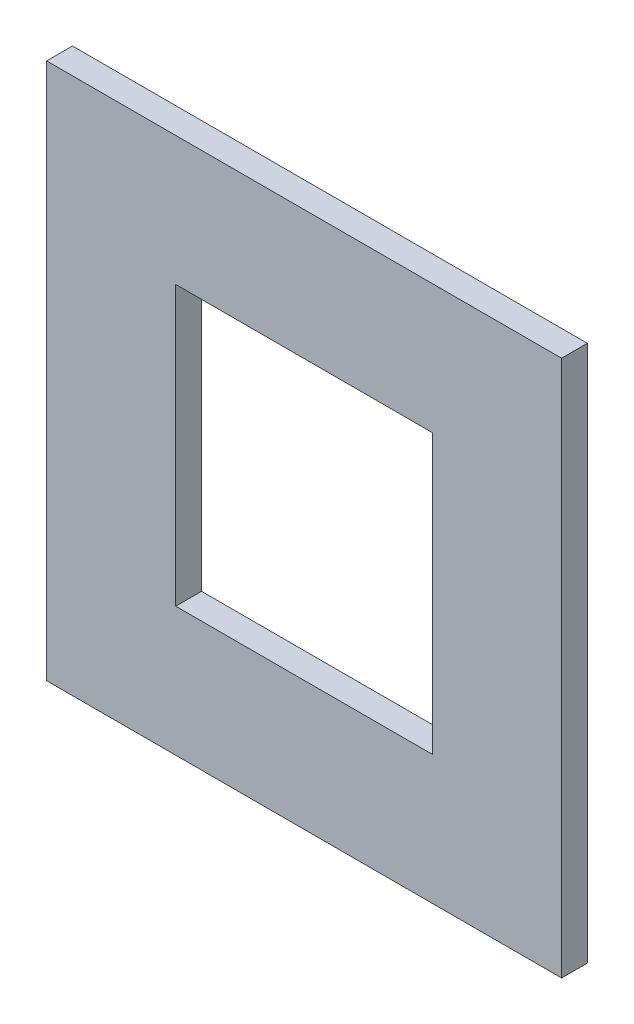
ISO-10303-21;
HEADER;
FILE_DESCRIPTION(('STEP AP214'),'2;1');
FILE_NAME('part.step','',(''),(''),'','','');
FILE_SCHEMA(('AUTOMOTIVE_DESIGN { 1 0 10303 214 1 1 1 1 }'));
ENDSEC;
DATA;
#1=APPLICATION_CONTEXT('core data for automotive mechanical design processes');
#2=APPLICATION_PROTOCOL_DEFINITION('international standard','automotive_design',2000,#1);
#3=PRODUCT_CONTEXT('',#1,'mechanical');
#4=PRODUCT('Part','Part','',(#3));
#5=PRODUCT_RELATED_PRODUCT_CATEGORY('part','',(#4));
#6=PRODUCT_DEFINITION_FORMATION('','',#4);
#7=PRODUCT_DEFINITION_CONTEXT('part definition',#1,'design');
#8=PRODUCT_DEFINITION('design','',#6,#7);
#9=PRODUCT_DEFINITION_SHAPE('','',#8);
#10=(LENGTH_UNIT() NAMED_UNIT(*) SI_UNIT(.MILLI.,.METRE.));
#11=(NAMED_UNIT(*) PLANE_ANGLE_UNIT() SI_UNIT($,.RADIAN.));
#12=(NAMED_UNIT(*) SI_UNIT($,.STERADIAN.) SOLID_ANGLE_UNIT());
#13=UNCERTAINTY_MEASURE_WITH_UNIT(LENGTH_MEASURE(1.E-05),#10,'distance_accuracy_value','');
#14=(GEOMETRIC_REPRESENTATION_CONTEXT(3) GLOBAL_UNCERTAINTY_ASSIGNED_CONTEXT((#13)) GLOBAL_UNIT_ASSIGNED_CONTEXT((#10,
#11,#12)) REPRESENTATION_CONTEXT('',''));
#15=CARTESIAN_POINT('',(0.,0.,0.));
#16=DIRECTION('',(0.,0.,1.));
#17=DIRECTION('',(1.,0.,0.));
#18=AXIS2_PLACEMENT_3D('',#15,#16,#17);
#19=CARTESIAN_POINT('',(0.,0.,15.));
#20=DIRECTION('',(0.,0.,1.));
#21=DIRECTION('',(1.,0.,0.));
#22=AXIS2_PLACEMENT_3D('',#19,#20,#21);
#23=PLANE('',#22);
#24=DIRECTION('',(1.,0.,0.));
#25=VECTOR('',#24,1.);
#26=CARTESIAN_POINT('',(74.6125,-80.9625,15.));
#27=LINE('',#26,#25);
#28=CARTESIAN_POINT('',(-74.6125,-80.9625,15.));
#29=VERTEX_POINT('',#28);
#30=CARTESIAN_POINT('',(74.6125,-80.9625,15.));
#31=VERTEX_POINT('',#30);
#32=EDGE_CURVE('E134',#29,#31,#27,.T.);
#33=ORIENTED_EDGE('',*,*,#32,.F.);
#34=DIRECTION('',(0.,-1.,0.));
#35=VECTOR('',#34,1.);
#36=CARTESIAN_POINT('',(-74.6125,-80.9625,15.));
#37=LINE('',#36,#35);
#38=CARTESIAN_POINT('',(-74.6125,80.9625,15.));
#39=VERTEX_POINT('',#38);
#40=EDGE_CURVE('E132',#39,#29,#37,.T.);
#41=ORIENTED_EDGE('',*,*,#40,.F.);
#42=DIRECTION('',(-1.,0.,0.));
#43=VECTOR('',#42,1.);
#44=CARTESIAN_POINT('',(74.6125,80.9625,15.));
#45=LINE('',#44,#43);
#46=CARTESIAN_POINT('',(74.6125,80.9625,15.));
#47=VERTEX_POINT('',#46);
#48=EDGE_CURVE('E140',#47,#39,#45,.T.);
#49=ORIENTED_EDGE('',*,*,#48,.F.);
#50=DIRECTION('',(0.,1.,0.));
#51=VECTOR('',#50,1.);
#52=CARTESIAN_POINT('',(74.6125,-80.9625,15.));
#53=LINE('',#52,#51);
#54=EDGE_CURVE('E137',#31,#47,#53,.T.);
#55=ORIENTED_EDGE('',*,*,#54,.F.);
#56=EDGE_LOOP('',(#33,#41,#49,#55));
#57=FACE_BOUND('',#56,.T.);
#58=DIRECTION('',(-1.,0.,0.));
#59=VECTOR('',#58,1.);
#60=CARTESIAN_POINT('',(149.6125,-155.9625,15.));
#61=LINE('',#60,#59);
#62=CARTESIAN_POINT('',(149.6125,-155.9625,15.));
#63=VERTEX_POINT('',#62);
#64=CARTESIAN_POINT('',(-149.6125,-155.9625,15.));
#65=VERTEX_POINT('',#64);
#66=EDGE_CURVE('E114',#63,#65,#61,.T.);
#67=ORIENTED_EDGE('',*,*,#66,.F.);
#68=DIRECTION('',(0.,-1.,0.));
#69=VECTOR('',#68,1.);
#70=CARTESIAN_POINT('',(149.6125,155.9625,15.));
#71=LINE('',#70,#69);
#72=CARTESIAN_POINT('',(149.6125,155.9625,15.));
#73=VERTEX_POINT('',#72);
#74=EDGE_CURVE('E48',#73,#63,#71,.T.);
#75=ORIENTED_EDGE('',*,*,#74,.F.);
#76=DIRECTION('',(1.,0.,0.));
#77=VECTOR('',#76,1.);
#78=CARTESIAN_POINT('',(149.6125,155.9625,15.));
#79=LINE('',#78,#77);
#80=CARTESIAN_POINT('',(-149.6125,155.9625,15.));
#81=VERTEX_POINT('',#80);
#82=EDGE_CURVE('E102',#81,#73,#79,.T.);
#83=ORIENTED_EDGE('',*,*,#82,.F.);
#84=DIRECTION('',(0.,1.,0.));
#85=VECTOR('',#84,1.);
#86=CARTESIAN_POINT('',(-149.6125,155.9625,15.));
#87=LINE('',#86,#85);
#88=EDGE_CURVE('E109',#65,#81,#87,.T.);
#89=ORIENTED_EDGE('',*,*,#88,.F.);
#90=EDGE_LOOP('',(#67,#75,#83,#89));
#91=FACE_BOUND('',#90,.T.);
#92=ADVANCED_FACE('F33',(#57,#91),#23,.T.);
#93=CARTESIAN_POINT('',(0.,0.,0.));
#94=DIRECTION('',(0.,0.,1.));
#95=DIRECTION('',(1.,0.,0.));
#96=AXIS2_PLACEMENT_3D('',#93,#94,#95);
#97=PLANE('',#96);
#98=DIRECTION('',(0.,-1.,0.));
#99=VECTOR('',#98,1.);
#100=CARTESIAN_POINT('',(-74.6125,-80.9625,0.));
#101=LINE('',#100,#99);
#102=CARTESIAN_POINT('',(-74.6125,80.9625,0.));
#103=VERTEX_POINT('',#102);
#104=CARTESIAN_POINT('',(-74.6125,-80.9625,0.));
#105=VERTEX_POINT('',#104);
#106=EDGE_CURVE('E129',#103,#105,#101,.T.);
#107=ORIENTED_EDGE('',*,*,#106,.T.);
#108=DIRECTION('',(1.,0.,0.));
#109=VECTOR('',#108,1.);
#110=CARTESIAN_POINT('',(74.6125,-80.9625,0.));
#111=LINE('',#110,#109);
#112=CARTESIAN_POINT('',(74.6125,-80.9625,0.));
#113=VERTEX_POINT('',#112);
#114=EDGE_CURVE('E145',#105,#113,#111,.T.);
#115=ORIENTED_EDGE('',*,*,#114,.T.);
#116=DIRECTION('',(0.,1.,0.));
#117=VECTOR('',#116,1.);
#118=CARTESIAN_POINT('',(74.6125,-80.9625,0.));
#119=LINE('',#118,#117);
#120=CARTESIAN_POINT('',(74.6125,80.9625,0.));
#121=VERTEX_POINT('',#120);
#122=EDGE_CURVE('E148',#113,#121,#119,.T.);
#123=ORIENTED_EDGE('',*,*,#122,.T.);
#124=DIRECTION('',(-1.,0.,0.));
#125=VECTOR('',#124,1.);
#126=CARTESIAN_POINT('',(74.6125,80.9625,0.));
#127=LINE('',#126,#125);
#128=EDGE_CURVE('E135',#121,#103,#127,.T.);
#129=ORIENTED_EDGE('',*,*,#128,.T.);
#130=EDGE_LOOP('',(#107,#115,#123,#129));
#131=FACE_BOUND('',#130,.T.);
#132=DIRECTION('',(0.,-1.,0.));
#133=VECTOR('',#132,1.);
#134=CARTESIAN_POINT('',(149.6125,155.9625,0.));
#135=LINE('',#134,#133);
#136=CARTESIAN_POINT('',(149.6125,155.9625,0.));
#137=VERTEX_POINT('',#136);
#138=CARTESIAN_POINT('',(149.6125,-155.9625,0.));
#139=VERTEX_POINT('',#138);
#140=EDGE_CURVE('E121',#137,#139,#135,.T.);
#141=ORIENTED_EDGE('',*,*,#140,.T.);
#142=DIRECTION('',(-1.,0.,0.));
#143=VECTOR('',#142,1.);
#144=CARTESIAN_POINT('',(149.6125,-155.9625,0.));
#145=LINE('',#144,#143);
#146=CARTESIAN_POINT('',(-149.6125,-155.9625,0.));
#147=VERTEX_POINT('',#146);
#148=EDGE_CURVE('E124',#139,#147,#145,.T.);
#149=ORIENTED_EDGE('',*,*,#148,.T.);
#150=DIRECTION('',(0.,1.,0.));
#151=VECTOR('',#150,1.);
#152=CARTESIAN_POINT('',(-149.6125,155.9625,0.));
#153=LINE('',#152,#151);
#154=CARTESIAN_POINT('',(-149.6125,155.9625,0.));
#155=VERTEX_POINT('',#154);
#156=EDGE_CURVE('E56',#147,#155,#153,.T.);
#157=ORIENTED_EDGE('',*,*,#156,.T.);
#158=DIRECTION('',(1.,0.,0.));
#159=VECTOR('',#158,1.);
#160=CARTESIAN_POINT('',(149.6125,155.9625,0.));
#161=LINE('',#160,#159);
#162=EDGE_CURVE('E104',#155,#137,#161,.T.);
#163=ORIENTED_EDGE('',*,*,#162,.T.);
#164=EDGE_LOOP('',(#141,#149,#157,#163));
#165=FACE_BOUND('',#164,.T.);
#166=ADVANCED_FACE('F35',(#131,#165),#97,.F.);
#167=CARTESIAN_POINT('',(-74.6125,-80.9625,15.));
#168=DIRECTION('',(1.,0.,0.));
#169=DIRECTION('',(0.,0.,-1.));
#170=AXIS2_PLACEMENT_3D('',#167,#168,#169);
#171=PLANE('',#170);
#172=ORIENTED_EDGE('',*,*,#106,.F.);
#173=DIRECTION('',(0.,0.,-1.));
#174=VECTOR('',#173,1.);
#175=CARTESIAN_POINT('',(-74.6125,80.9625,15.));
#176=LINE('',#175,#174);
#177=EDGE_CURVE('E142',#39,#103,#176,.T.);
#178=ORIENTED_EDGE('',*,*,#177,.F.);
#179=ORIENTED_EDGE('',*,*,#40,.T.);
#180=DIRECTION('',(0.,0.,-1.));
#181=VECTOR('',#180,1.);
#182=CARTESIAN_POINT('',(-74.6125,-80.9625,15.));
#183=LINE('',#182,#181);
#184=EDGE_CURVE('E11',#29,#105,#183,.T.);
#185=ORIENTED_EDGE('',*,*,#184,.T.);
#186=EDGE_LOOP('',(#172,#178,#179,#185));
#187=FACE_BOUND('',#186,.T.);
#188=ADVANCED_FACE('F170',(#187),#171,.T.);
#189=CARTESIAN_POINT('',(74.6125,-80.9625,15.));
#190=DIRECTION('',(0.,1.,0.));
#191=DIRECTION('',(-1.,0.,0.));
#192=AXIS2_PLACEMENT_3D('',#189,#190,#191);
#193=PLANE('',#192);
#194=ORIENTED_EDGE('',*,*,#114,.F.);
#195=ORIENTED_EDGE('',*,*,#184,.F.);
#196=ORIENTED_EDGE('',*,*,#32,.T.);
#197=DIRECTION('',(0.,0.,-1.));
#198=VECTOR('',#197,1.);
#199=CARTESIAN_POINT('',(74.6125,-80.9625,15.));
#200=LINE('',#199,#198);
#201=EDGE_CURVE('E41',#31,#113,#200,.T.);
#202=ORIENTED_EDGE('',*,*,#201,.T.);
#203=EDGE_LOOP('',(#194,#195,#196,#202));
#204=FACE_BOUND('',#203,.T.);
#205=ADVANCED_FACE('F159',(#204),#193,.T.);
#206=CARTESIAN_POINT('',(74.6125,-80.9625,15.));
#207=DIRECTION('',(-1.,0.,0.));
#208=DIRECTION('',(0.,0.,1.));
#209=AXIS2_PLACEMENT_3D('',#206,#207,#208);
#210=PLANE('',#209);
#211=ORIENTED_EDGE('',*,*,#122,.F.);
#212=ORIENTED_EDGE('',*,*,#201,.F.);
#213=ORIENTED_EDGE('',*,*,#54,.T.);
#214=DIRECTION('',(0.,0.,-1.));
#215=VECTOR('',#214,1.);
#216=CARTESIAN_POINT('',(74.6125,80.9625,15.));
#217=LINE('',#216,#215);
#218=EDGE_CURVE('E155',#47,#121,#217,.T.);
#219=ORIENTED_EDGE('',*,*,#218,.T.);
#220=EDGE_LOOP('',(#211,#212,#213,#219));
#221=FACE_BOUND('',#220,.T.);
#222=ADVANCED_FACE('F164',(#221),#210,.T.);
#223=CARTESIAN_POINT('',(74.6125,80.9625,15.));
#224=DIRECTION('',(0.,-1.,0.));
#225=DIRECTION('',(1.,0.,0.));
#226=AXIS2_PLACEMENT_3D('',#223,#224,#225);
#227=PLANE('',#226);
#228=ORIENTED_EDGE('',*,*,#128,.F.);
#229=ORIENTED_EDGE('',*,*,#218,.F.);
#230=ORIENTED_EDGE('',*,*,#48,.T.);
#231=ORIENTED_EDGE('',*,*,#177,.T.);
#232=EDGE_LOOP('',(#228,#229,#230,#231));
#233=FACE_BOUND('',#232,.T.);
#234=ADVANCED_FACE('F173',(#233),#227,.T.);
#235=CARTESIAN_POINT('',(149.6125,155.9625,15.));
#236=DIRECTION('',(1.,0.,0.));
#237=DIRECTION('',(0.,1.,0.));
#238=AXIS2_PLACEMENT_3D('',#235,#236,#237);
#239=PLANE('',#238);
#240=ORIENTED_EDGE('',*,*,#140,.F.);
#241=DIRECTION('',(0.,0.,-1.));
#242=VECTOR('',#241,1.);
#243=CARTESIAN_POINT('',(149.6125,155.9625,15.));
#244=LINE('',#243,#242);
#245=EDGE_CURVE('E105',#73,#137,#244,.T.);
#246=ORIENTED_EDGE('',*,*,#245,.F.);
#247=ORIENTED_EDGE('',*,*,#74,.T.);
#248=DIRECTION('',(0.,0.,-1.));
#249=VECTOR('',#248,1.);
#250=CARTESIAN_POINT('',(149.6125,-155.9625,15.));
#251=LINE('',#250,#249);
#252=EDGE_CURVE('E116',#63,#139,#251,.T.);
#253=ORIENTED_EDGE('',*,*,#252,.T.);
#254=EDGE_LOOP('',(#240,#246,#247,#253));
#255=FACE_BOUND('',#254,.T.);
#256=ADVANCED_FACE('F189',(#255),#239,.T.);
#257=CARTESIAN_POINT('',(149.6125,155.9625,15.));
#258=DIRECTION('',(0.,1.,0.));
#259=DIRECTION('',(0.,0.,1.));
#260=AXIS2_PLACEMENT_3D('',#257,#258,#259);
#261=PLANE('',#260);
#262=ORIENTED_EDGE('',*,*,#162,.F.);
#263=DIRECTION('',(0.,0.,-1.));
#264=VECTOR('',#263,1.);
#265=CARTESIAN_POINT('',(-149.6125,155.9625,15.));
#266=LINE('',#265,#264);
#267=EDGE_CURVE('E98',#81,#155,#266,.T.);
#268=ORIENTED_EDGE('',*,*,#267,.F.);
#269=ORIENTED_EDGE('',*,*,#82,.T.);
#270=ORIENTED_EDGE('',*,*,#245,.T.);
#271=EDGE_LOOP('',(#262,#268,#269,#270));
#272=FACE_BOUND('',#271,.T.);
#273=ADVANCED_FACE('F100',(#272),#261,.T.);
#274=CARTESIAN_POINT('',(-149.6125,155.9625,15.));
#275=DIRECTION('',(-1.,0.,0.));
#276=DIRECTION('',(0.,-1.,0.));
#277=AXIS2_PLACEMENT_3D('',#274,#275,#276);
#278=PLANE('',#277);
#279=ORIENTED_EDGE('',*,*,#156,.F.);
#280=DIRECTION('',(0.,0.,-1.));
#281=VECTOR('',#280,1.);
#282=CARTESIAN_POINT('',(-149.6125,-155.9625,15.));
#283=LINE('',#282,#281);
#284=EDGE_CURVE('E106',#65,#147,#283,.T.);
#285=ORIENTED_EDGE('',*,*,#284,.F.);
#286=ORIENTED_EDGE('',*,*,#88,.T.);
#287=ORIENTED_EDGE('',*,*,#267,.T.);
#288=EDGE_LOOP('',(#279,#285,#286,#287));
#289=FACE_BOUND('',#288,.T.);
#290=ADVANCED_FACE('F110',(#289),#278,.T.);
#291=CARTESIAN_POINT('',(149.6125,-155.9625,15.));
#292=DIRECTION('',(0.,-1.,0.));
#293=DIRECTION('',(0.,0.,-1.));
#294=AXIS2_PLACEMENT_3D('',#291,#292,#293);
#295=PLANE('',#294);
#296=ORIENTED_EDGE('',*,*,#148,.F.);
#297=ORIENTED_EDGE('',*,*,#252,.F.);
#298=ORIENTED_EDGE('',*,*,#66,.T.);
#299=ORIENTED_EDGE('',*,*,#284,.T.);
#300=EDGE_LOOP('',(#296,#297,#298,#299));
#301=FACE_BOUND('',#300,.T.);
#302=ADVANCED_FACE('F192',(#301),#295,.T.);
#303=CLOSED_SHELL('',(#92,#166,#188,#205,#222,#234,#256,#273,#290,#302));
#304=MANIFOLD_SOLID_BREP('B2',#303);
#305=ADVANCED_BREP_SHAPE_REPRESENTATION('',(#18,#304),#14);
#306=SHAPE_DEFINITION_REPRESENTATION(#9,#305);
ENDSEC;
END-ISO-10303-21;
